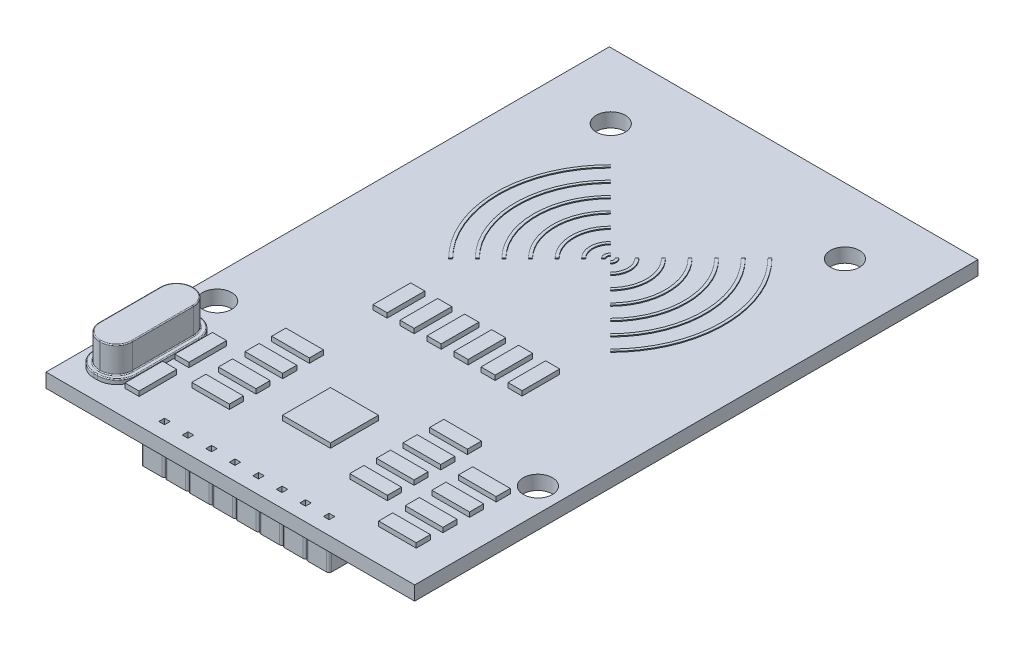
from build123d import *

# Parameters (mm, degrees)
SKETCH1_W                = 39.2
SKETCH1_H                = 59.9
BOSS_EXTRUDE1_DEPTH      = 1.5
SKETCH3_R                = 1.55
CUT_EXTRUDE1_DEPTH       = 1.5
BOSS_EXTRUDE3_DEPTH      = 2.5
SKETCH5_W                = 0.6
SKETCH5_H                = 0.6
CUT_EXTRUDE2_DEPTH       = 4
BOSS_EXTRUDE4_DEPTH      = 0.5
BOSS_EXTRUDE5_DEPTH      = 2.8
FILLET1_R                = 0.1
BOSS_EXTRUDE6_DEPTH      = 0.1
ESBO_O1_W                = 1.5
ESBO_O1_H                = 4
ESBO_O1_W_2              = 4
ESBO_O1_H_2              = 1.5
RESSALTO_EXTRUS_O1_DEPTH = 0.5
ESBO_O2_W                = 5.1
ESBO_O2_H                = 5.1
RESSALTO_EXTRUS_O2_DEPTH = 0.5


with BuildPart() as part:
    # Sketch1 → Boss-Extrude1 (new body)
    with BuildSketch(Plane(origin=(0, 0, 0), x_dir=(1, 0, 0), z_dir=(0, 1, 0))):
        Rectangle(SKETCH1_W, SKETCH1_H)
    extrude(amount=BOSS_EXTRUDE1_DEPTH)

    # Sketch3 → Cut-Extrude1 (cut)
    with BuildSketch(Plane(origin=(0, 1.5, 0), x_dir=(1, 0, 0), z_dir=(0, 1, 0))):
        with Locations(Location((12.45, 22.95, 0), (0, 0, 270))):
            Circle(SKETCH3_R)
        with Locations(Location((-12.45, 22.95, 0), (0, 0, 270))):
            Circle(SKETCH3_R)
        with Locations(Location((17.05, -14.3, 0), (0, 0, 270))):
            Circle(SKETCH3_R)
        with Locations(Location((-17.05, -14.3, 0), (0, 0, 270))):
            Circle(SKETCH3_R)
    extrude(amount=-CUT_EXTRUDE1_DEPTH, mode=Mode.SUBTRACT)

    # Sketch4 → Boss-Extrude3 (add)
    with BuildSketch(Plane(origin=(0, 0, 0), x_dir=(1, 0, 0), z_dir=(0, 1, 0))):
        with BuildLine():
            Line((-9.75, -26.95), (-7.75, -26.95))
            ThreePointArc((-7.75, -26.95), (-7.573223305, -27.023223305), (-7.5, -27.2))
            ThreePointArc((-7.5, -27.2), (-7.426776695, -27.023223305), (-7.25, -26.95))
            Line((-7.25, -26.95), (-5.25, -26.95))
            ThreePointArc((-5.25, -26.95), (-5.073223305, -27.023223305), (-5, -27.2))
            ThreePointArc((-5, -27.2), (-4.926776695, -27.023223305), (-4.75, -26.95))
            Line((-4.75, -26.95), (-2.75, -26.95))
            ThreePointArc((-2.75, -26.95), (-2.573223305, -27.023223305), (-2.5, -27.2))
            ThreePointArc((-2.5, -27.2), (-2.426776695, -27.023223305), (-2.25, -26.95))
            Line((-2.25, -26.95), (-0.25, -26.95))
            ThreePointArc((-0.25, -26.95), (-0.073223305, -27.023223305), (0, -27.2))
            ThreePointArc((0, -27.2), (0.073223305, -27.023223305), (0.25, -26.95))
            Line((0.25, -26.95), (2.25, -26.95))
            ThreePointArc((2.25, -26.95), (2.426776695, -27.023223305), (2.5, -27.2))
            ThreePointArc((2.5, -27.2), (2.573223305, -27.023223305), (2.75, -26.95))
            Line((2.75, -26.95), (4.75, -26.95))
            ThreePointArc((4.75, -26.95), (4.926776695, -27.023223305), (5, -27.2))
            ThreePointArc((5, -27.2), (5.073223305, -27.023223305), (5.25, -26.95))
            Line((5.25, -26.95), (7.25, -26.95))
            ThreePointArc((7.25, -26.95), (7.426776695, -27.023223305), (7.5, -27.2))
            ThreePointArc((7.5, -27.2), (7.573223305, -27.023223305), (7.75, -26.95))
            Line((7.75, -26.95), (9.75, -26.95))
            ThreePointArc((9.75, -26.95), (9.926776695, -27.023223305), (10, -27.2))
            Line((10, -27.2), (10, -29.2))
            ThreePointArc((10, -29.2), (9.926776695, -29.376776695), (9.75, -29.45))
            Line((9.75, -29.45), (7.75, -29.45))
            ThreePointArc((7.75, -29.45), (7.573223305, -29.376776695), (7.5, -29.2))
            ThreePointArc((7.5, -29.2), (7.426776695, -29.376776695), (7.25, -29.45))
            Line((7.25, -29.45), (5.25, -29.45))
            ThreePointArc((5.25, -29.45), (5.073223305, -29.376776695), (5, -29.2))
            ThreePointArc((5, -29.2), (4.926776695, -29.376776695), (4.75, -29.45))
            Line((4.75, -29.45), (2.75, -29.45))
            ThreePointArc((2.75, -29.45), (2.573223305, -29.376776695), (2.5, -29.2))
            ThreePointArc((2.5, -29.2), (2.426776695, -29.376776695), (2.25, -29.45))
            Line((2.25, -29.45), (0.25, -29.45))
            ThreePointArc((0.25, -29.45), (0.073223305, -29.376776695), (0, -29.2))
            ThreePointArc((0, -29.2), (-0.073223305, -29.376776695), (-0.25, -29.45))
            Line((-0.25, -29.45), (-2.25, -29.45))
            ThreePointArc((-2.25, -29.45), (-2.426776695, -29.376776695), (-2.5, -29.2))
            ThreePointArc((-2.5, -29.2), (-2.573223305, -29.376776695), (-2.75, -29.45))
            Line((-2.75, -29.45), (-4.75, -29.45))
            ThreePointArc((-4.75, -29.45), (-4.926776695, -29.376776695), (-5, -29.2))
            ThreePointArc((-5, -29.2), (-5.073223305, -29.376776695), (-5.25, -29.45))
            Line((-5.25, -29.45), (-7.25, -29.45))
            ThreePointArc((-7.25, -29.45), (-7.426776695, -29.376776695), (-7.5, -29.2))
            ThreePointArc((-7.5, -29.2), (-7.573223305, -29.376776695), (-7.75, -29.45))
            Line((-7.75, -29.45), (-9.75, -29.45))
            ThreePointArc((-9.75, -29.45), (-9.926776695, -29.376776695), (-10, -29.2))
            Line((-10, -29.2), (-10, -27.2))
            ThreePointArc((-10, -27.2), (-9.926776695, -27.023223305), (-9.75, -26.95))
        make_face()
    extrude(amount=-BOSS_EXTRUDE3_DEPTH)

    # Sketch5 → Cut-Extrude2 (cut)
    with BuildSketch(Plane(origin=(0, -2.5, 0), x_dir=(-1, 0, 0), z_dir=(0, -1, 0))):
        with Locations((-8.75, -28.2)):
            Rectangle(SKETCH5_W, SKETCH5_H)
        with Locations((-6.25, -28.2)):
            Rectangle(SKETCH5_W, SKETCH5_H)
        with Locations((-3.75, -28.2)):
            Rectangle(SKETCH5_W, SKETCH5_H)
        with Locations((-1.25, -28.2)):
            Rectangle(SKETCH5_W, SKETCH5_H)
        with Locations((1.25, -28.2)):
            Rectangle(SKETCH5_W, SKETCH5_H)
        with Locations((3.75, -28.2)):
            Rectangle(SKETCH5_W, SKETCH5_H)
        with Locations((6.25, -28.2)):
            Rectangle(SKETCH5_W, SKETCH5_H)
        with Locations((8.75, -28.2)):
            Rectangle(SKETCH5_W, SKETCH5_H)
    extrude(amount=-CUT_EXTRUDE2_DEPTH, mode=Mode.SUBTRACT)

    # Sketch8 → Boss-Extrude4 (add)
    with BuildSketch(Plane(origin=(0, 1.5, 0), x_dir=(1, 0, 0), z_dir=(0, 1, 0))):
        with BuildLine():
            Line((-16.5, -17.15), (-16.15, -17.15))
            ThreePointArc((-16.15, -17.15), (-14.66507576, -17.76507576), (-14.05, -19.25))
            Line((-14.05, -19.25), (-14.05, -25.85))
            ThreePointArc((-14.05, -25.85), (-14.66507576, -27.33492424), (-16.15, -27.95))
            Line((-16.15, -27.95), (-16.5, -27.95))
            ThreePointArc((-16.5, -27.95), (-17.98492424, -27.33492424), (-18.6, -25.85))
            Line((-18.6, -25.85), (-18.6, -19.25))
            ThreePointArc((-18.6, -19.25), (-17.98492424, -17.76507576), (-16.5, -17.15))
        make_face()
    extrude(amount=BOSS_EXTRUDE4_DEPTH)

    # Sketch10 → Boss-Extrude5 (add)
    with BuildSketch(Plane(origin=(0, 2, 0), x_dir=(1, 0, 0), z_dir=(0, 1, 0))):
        with BuildLine():
            Line((-16.375, -17.6), (-16.275, -17.6))
            ThreePointArc((-16.275, -17.6), (-15.072918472, -18.097918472), (-14.575, -19.3))
            Line((-14.575, -19.3), (-14.575, -25.8))
            ThreePointArc((-14.575, -25.8), (-15.072918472, -27.002081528), (-16.275, -27.5))
            Line((-16.275, -27.5), (-16.375, -27.5))
            ThreePointArc((-16.375, -27.5), (-17.577081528, -27.002081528), (-18.075, -25.8))
            Line((-18.075, -25.8), (-18.075, -19.3))
            ThreePointArc((-18.075, -19.3), (-17.577081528, -18.097918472), (-16.375, -17.6))
        make_face()
    extrude(amount=BOSS_EXTRUDE5_DEPTH)

    # Fillet1
    fillet1_edges = [part.edges().sort_by_distance(p)[0] for p in [
        (-17.98492424, 2, 27.33492424),
        (-16.325, 2, 27.95),
        (-14.66507576, 2, 27.33492424),
        (-14.05, 2, 22.55),
        (-14.66507576, 2, 17.76507576),
        (-16.325, 2, 17.15),
        (-17.98492424, 2, 17.76507576),
        (-18.6, 2, 22.55),
        (-17.577081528, 2, 27.002081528),
        (-16.325, 2, 27.5),
        (-15.072918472, 2, 27.002081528),
        (-14.575, 2, 22.55),
        (-15.072918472, 2, 18.097918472),
        (-16.325, 2, 17.6),
        (-17.577081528, 2, 18.097918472),
        (-18.075, 2, 22.55),
        (-17.577081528, 4.8, 27.002081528),
        (-16.325, 4.8, 27.5),
        (-15.072918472, 4.8, 27.002081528),
        (-14.575, 4.8, 22.55),
        (-15.072918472, 4.8, 18.097918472),
        (-16.325, 4.8, 17.6),
        (-17.577081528, 4.8, 18.097918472),
        (-18.075, 4.8, 22.55),
    ]]
    fillet(fillet1_edges, radius=FILLET1_R)

    # Sketch11 → Boss-Extrude6 (add)
    with BuildSketch(Plane(origin=(0, 1.5, 0), x_dir=(1, 0, 0), z_dir=(0, 1, 0))):
        with BuildLine():
            Line((-0.247487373, 10.697487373), (-0.459619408, 10.909619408))
            ThreePointArc((-0.459619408, 10.909619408), (-0.65, 10.45), (-0.459619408, 9.990380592))
            Line((-0.459619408, 9.990380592), (-0.247487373, 10.202512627))
            ThreePointArc((-0.247487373, 10.202512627), (-0.35, 10.45), (-0.247487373, 10.697487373))
        make_face()
        with BuildLine():
            Line((0.247487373, 10.697487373), (0.459619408, 10.909619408))
            ThreePointArc((0.459619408, 10.909619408), (0.65, 10.45), (0.459619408, 9.990380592))
            Line((0.459619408, 9.990380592), (0.247487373, 10.202512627))
            ThreePointArc((0.247487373, 10.202512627), (0.35, 10.45), (0.247487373, 10.697487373))
        make_face()
        with BuildLine():
            Line((-8.485281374, 18.935281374), (-8.591347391, 19.041347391))
            ThreePointArc((-8.591347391, 19.041347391), (-12.15, 10.45), (-8.591347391, 1.858652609))
            Line((-8.591347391, 1.858652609), (-8.485281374, 1.964718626))
            Line((-8.485281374, 1.964718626), (-8.379215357, 2.070784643))
            ThreePointArc((-8.379215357, 2.070784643), (-11.85, 10.45), (-8.379215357, 18.829215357))
            Line((-8.379215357, 18.829215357), (-8.485281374, 18.935281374))
        make_face()
        with BuildLine():
            Line((8.485281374, 1.964718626), (8.591347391, 1.858652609))
            ThreePointArc((8.591347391, 1.858652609), (12.15, 10.45), (8.591347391, 19.041347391))
            Line((8.591347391, 19.041347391), (8.485281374, 18.935281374))
            Line((8.485281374, 18.935281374), (8.379215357, 18.829215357))
            ThreePointArc((8.379215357, 18.829215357), (11.85, 10.45), (8.379215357, 2.070784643))
            Line((8.379215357, 2.070784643), (8.485281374, 1.964718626))
        make_face()
        with BuildLine():
            Line((-6.965001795, 17.415001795), (-7.177133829, 17.627133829))
            ThreePointArc((-7.177133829, 17.627133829), (-10.15, 10.45), (-7.177133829, 3.272866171))
            Line((-7.177133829, 3.272866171), (-6.965001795, 3.484998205))
            ThreePointArc((-6.965001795, 3.484998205), (-9.85, 10.45), (-6.965001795, 17.415001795))
        make_face()
        with BuildLine():
            Line((-5.550788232, 16.000788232), (-5.762920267, 16.212920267))
            ThreePointArc((-5.762920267, 16.212920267), (-8.15, 10.45), (-5.762920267, 4.687079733))
            Line((-5.762920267, 4.687079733), (-5.550788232, 4.899211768))
            ThreePointArc((-5.550788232, 4.899211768), (-7.85, 10.45), (-5.550788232, 16.000788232))
        make_face()
        with BuildLine():
            Line((-4.13657467, 14.58657467), (-4.348706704, 14.798706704))
            ThreePointArc((-4.348706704, 14.798706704), (-6.15, 10.45), (-4.348706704, 6.101293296))
            Line((-4.348706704, 6.101293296), (-4.13657467, 6.31342533))
            ThreePointArc((-4.13657467, 6.31342533), (-5.85, 10.45), (-4.13657467, 14.58657467))
        make_face()
        with BuildLine():
            Line((-2.722361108, 13.172361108), (-2.934493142, 13.384493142))
            ThreePointArc((-2.934493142, 13.384493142), (-4.15, 10.45), (-2.934493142, 7.515506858))
            Line((-2.934493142, 7.515506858), (-2.722361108, 7.727638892))
            ThreePointArc((-2.722361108, 7.727638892), (-3.85, 10.45), (-2.722361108, 13.172361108))
        make_face()
        with BuildLine():
            Line((-1.308147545, 11.758147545), (-1.52027958, 11.97027958))
            ThreePointArc((-1.52027958, 11.97027958), (-2.15, 10.45), (-1.52027958, 8.92972042))
            Line((-1.52027958, 8.92972042), (-1.308147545, 9.141852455))
            ThreePointArc((-1.308147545, 9.141852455), (-1.85, 10.45), (-1.308147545, 11.758147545))
        make_face()
        with BuildLine():
            Line((1.308147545, 9.141852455), (1.52027958, 8.92972042))
            ThreePointArc((1.52027958, 8.92972042), (2.15, 10.45), (1.52027958, 11.97027958))
            Line((1.52027958, 11.97027958), (1.308147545, 11.758147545))
            ThreePointArc((1.308147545, 11.758147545), (1.85, 10.45), (1.308147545, 9.141852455))
        make_face()
        with BuildLine():
            Line((2.722361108, 7.727638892), (2.934493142, 7.515506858))
            ThreePointArc((2.934493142, 7.515506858), (4.15, 10.45), (2.934493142, 13.384493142))
            Line((2.934493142, 13.384493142), (2.722361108, 13.172361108))
            ThreePointArc((2.722361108, 13.172361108), (3.85, 10.45), (2.722361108, 7.727638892))
        make_face()
        with BuildLine():
            Line((4.13657467, 6.31342533), (4.348706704, 6.101293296))
            ThreePointArc((4.348706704, 6.101293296), (6.15, 10.45), (4.348706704, 14.798706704))
            Line((4.348706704, 14.798706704), (4.13657467, 14.58657467))
            ThreePointArc((4.13657467, 14.58657467), (5.85, 10.45), (4.13657467, 6.31342533))
        make_face()
        with BuildLine():
            Line((5.550788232, 4.899211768), (5.762920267, 4.687079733))
            ThreePointArc((5.762920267, 4.687079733), (8.15, 10.45), (5.762920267, 16.212920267))
            Line((5.762920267, 16.212920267), (5.550788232, 16.000788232))
            ThreePointArc((5.550788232, 16.000788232), (7.85, 10.45), (5.550788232, 4.899211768))
        make_face()
        with BuildLine():
            Line((6.965001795, 3.484998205), (7.177133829, 3.272866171))
            ThreePointArc((7.177133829, 3.272866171), (10.15, 10.45), (7.177133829, 17.627133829))
            Line((7.177133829, 17.627133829), (6.965001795, 17.415001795))
            ThreePointArc((6.965001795, 17.415001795), (9.85, 10.45), (6.965001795, 3.484998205))
        make_face()
    extrude(amount=BOSS_EXTRUDE6_DEPTH)

    # Esbo_o1 → Ressalto-extrus_o1 (add)
    with BuildSketch(Plane(origin=(0, 1.5, 0), x_dir=(1, 0, 0), z_dir=(0, 1, 0))):
        with Locations((7.175, -4.85)):
            Rectangle(ESBO_O1_W, ESBO_O1_H)
        with Locations((4.305, -4.85)):
            Rectangle(ESBO_O1_W, ESBO_O1_H)
        with Locations((1.435, -4.85)):
            Rectangle(ESBO_O1_W, ESBO_O1_H)
        with Locations((-1.435, -4.85)):
            Rectangle(ESBO_O1_W, ESBO_O1_H)
        with Locations((-4.305, -4.85)):
            Rectangle(ESBO_O1_W, ESBO_O1_H)
        with Locations((-7.175, -4.85)):
            Rectangle(ESBO_O1_W, ESBO_O1_H)
        with Locations((-8.4, -22.9)):
            Rectangle(ESBO_O1_W_2, ESBO_O1_H_2)
        with Locations((-8.4, -20.066666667)):
            Rectangle(ESBO_O1_W_2, ESBO_O1_H_2)
        with Locations((-8.4, -17.233333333)):
            Rectangle(ESBO_O1_W_2, ESBO_O1_H_2)
        with Locations((-8.4, -14.4)):
            Rectangle(ESBO_O1_W_2, ESBO_O1_H_2)
        with Locations((8.4, -14.4)):
            Rectangle(ESBO_O1_W_2, ESBO_O1_H_2)
        with Locations((8.4, -17.233333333)):
            Rectangle(ESBO_O1_W_2, ESBO_O1_H_2)
        with Locations((8.4, -20.066666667)):
            Rectangle(ESBO_O1_W_2, ESBO_O1_H_2)
        with Locations((8.4, -22.9)):
            Rectangle(ESBO_O1_W_2, ESBO_O1_H_2)
        with Locations((-13.15, -19.95)):
            Rectangle(ESBO_O1_W, ESBO_O1_H)
        with Locations((-13.15, -25.25)):
            Rectangle(ESBO_O1_W, ESBO_O1_H)
        with Locations((14.3, -17.233333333)):
            Rectangle(ESBO_O1_W_2, ESBO_O1_H_2)
        with Locations((14.3, -20.066666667)):
            Rectangle(ESBO_O1_W_2, ESBO_O1_H_2)
        with Locations((14.3, -22.9)):
            Rectangle(ESBO_O1_W_2, ESBO_O1_H_2)
        with Locations((14.3, -25.733333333)):
            Rectangle(ESBO_O1_W_2, ESBO_O1_H_2)
    extrude(amount=RESSALTO_EXTRUS_O1_DEPTH)

    # Esbo_o2 → Ressalto-extrus_o2 (add)
    with BuildSketch(Plane(origin=(0, 1.5, 0), x_dir=(1, 0, 0), z_dir=(0, 1, 0))):
        with Locations((0, -19.3)):
            Rectangle(ESBO_O2_W, ESBO_O2_H)
    extrude(amount=RESSALTO_EXTRUS_O2_DEPTH)


solid = part.part
